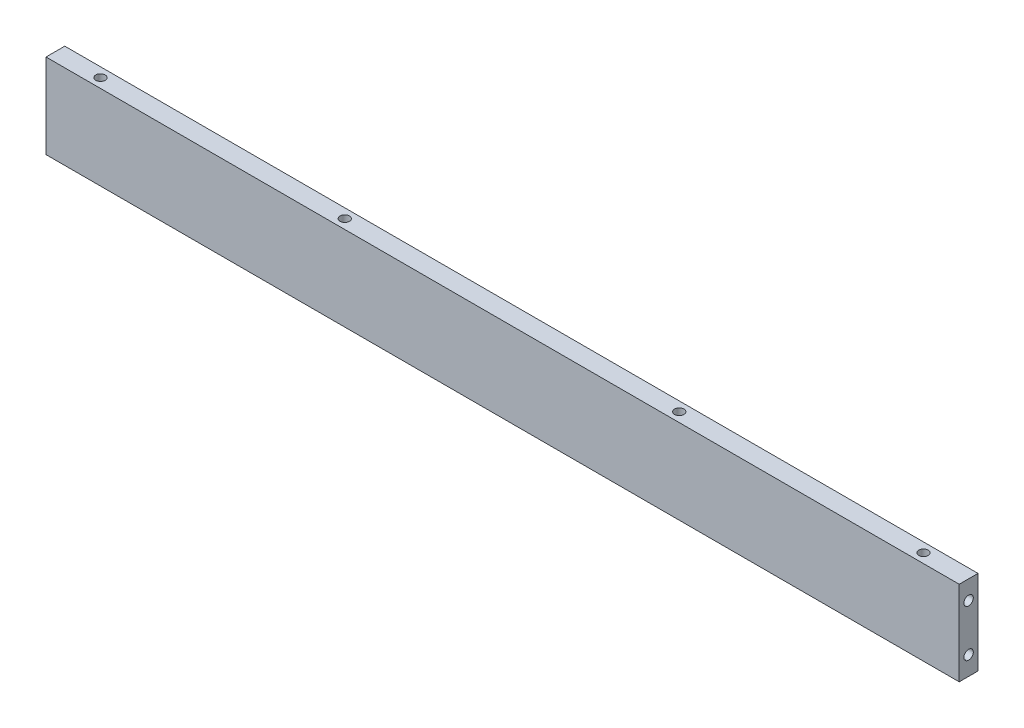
ISO-10303-21;
HEADER;
FILE_DESCRIPTION(('STEP AP214'),'2;1');
FILE_NAME('part.step','',(''),(''),'','','');
FILE_SCHEMA(('AUTOMOTIVE_DESIGN { 1 0 10303 214 1 1 1 1 }'));
ENDSEC;
DATA;
#1=APPLICATION_CONTEXT('core data for automotive mechanical design processes');
#2=APPLICATION_PROTOCOL_DEFINITION('international standard','automotive_design',2000,#1);
#3=PRODUCT_CONTEXT('',#1,'mechanical');
#4=PRODUCT('Part','Part','',(#3));
#5=PRODUCT_RELATED_PRODUCT_CATEGORY('part','',(#4));
#6=PRODUCT_DEFINITION_FORMATION('','',#4);
#7=PRODUCT_DEFINITION_CONTEXT('part definition',#1,'design');
#8=PRODUCT_DEFINITION('design','',#6,#7);
#9=PRODUCT_DEFINITION_SHAPE('','',#8);
#10=(LENGTH_UNIT() NAMED_UNIT(*) SI_UNIT(.MILLI.,.METRE.));
#11=(NAMED_UNIT(*) PLANE_ANGLE_UNIT() SI_UNIT($,.RADIAN.));
#12=(NAMED_UNIT(*) SI_UNIT($,.STERADIAN.) SOLID_ANGLE_UNIT());
#13=UNCERTAINTY_MEASURE_WITH_UNIT(LENGTH_MEASURE(1.E-05),#10,'distance_accuracy_value','');
#14=(GEOMETRIC_REPRESENTATION_CONTEXT(3) GLOBAL_UNCERTAINTY_ASSIGNED_CONTEXT((#13)) GLOBAL_UNIT_ASSIGNED_CONTEXT((#10,
#11,#12)) REPRESENTATION_CONTEXT('',''));
#15=CARTESIAN_POINT('',(0.,0.,0.));
#16=DIRECTION('',(0.,0.,1.));
#17=DIRECTION('',(1.,0.,0.));
#18=AXIS2_PLACEMENT_3D('',#15,#16,#17);
#19=CARTESIAN_POINT('',(308.61,28.575,6.35));
#20=DIRECTION('',(-1.,0.,0.));
#21=DIRECTION('',(0.,0.,1.));
#22=AXIS2_PLACEMENT_3D('',#19,#20,#21);
#23=PLANE('',#22);
#24=CARTESIAN_POINT('',(308.61,15.875,0.));
#25=DIRECTION('',(1.,0.,0.));
#26=DIRECTION('',(0.,0.,-1.));
#27=AXIS2_PLACEMENT_3D('',#24,#25,#26);
#28=CIRCLE('',#27,3.175);
#29=CARTESIAN_POINT('',(308.61,15.875,-3.175));
#30=VERTEX_POINT('',#29);
#31=EDGE_CURVE('E155',#30,#30,#28,.T.);
#32=ORIENTED_EDGE('',*,*,#31,.F.);
#33=EDGE_LOOP('',(#32));
#34=FACE_BOUND('',#33,.T.);
#35=CARTESIAN_POINT('',(308.61,-15.875,0.));
#36=DIRECTION('',(1.,0.,0.));
#37=DIRECTION('',(0.,0.,-1.));
#38=AXIS2_PLACEMENT_3D('',#35,#36,#37);
#39=CIRCLE('',#38,3.175);
#40=CARTESIAN_POINT('',(308.61,-15.875,-3.175));
#41=VERTEX_POINT('',#40);
#42=EDGE_CURVE('E149',#41,#41,#39,.T.);
#43=ORIENTED_EDGE('',*,*,#42,.F.);
#44=EDGE_LOOP('',(#43));
#45=FACE_BOUND('',#44,.T.);
#46=DIRECTION('',(0.,1.,0.));
#47=VECTOR('',#46,1.);
#48=CARTESIAN_POINT('',(308.61,28.575,-6.35));
#49=LINE('',#48,#47);
#50=CARTESIAN_POINT('',(308.61,-28.575,-6.35));
#51=VERTEX_POINT('',#50);
#52=CARTESIAN_POINT('',(308.61,28.575,-6.35));
#53=VERTEX_POINT('',#52);
#54=EDGE_CURVE('E111',#51,#53,#49,.T.);
#55=ORIENTED_EDGE('',*,*,#54,.T.);
#56=DIRECTION('',(0.,0.,-1.));
#57=VECTOR('',#56,1.);
#58=CARTESIAN_POINT('',(308.61,28.575,6.35));
#59=LINE('',#58,#57);
#60=CARTESIAN_POINT('',(308.61,28.575,6.35));
#61=VERTEX_POINT('',#60);
#62=EDGE_CURVE('E13',#61,#53,#59,.T.);
#63=ORIENTED_EDGE('',*,*,#62,.F.);
#64=DIRECTION('',(0.,1.,0.));
#65=VECTOR('',#64,1.);
#66=CARTESIAN_POINT('',(308.61,28.575,6.35));
#67=LINE('',#66,#65);
#68=CARTESIAN_POINT('',(308.61,-28.575,6.35));
#69=VERTEX_POINT('',#68);
#70=EDGE_CURVE('E99',#69,#61,#67,.T.);
#71=ORIENTED_EDGE('',*,*,#70,.F.);
#72=DIRECTION('',(0.,0.,-1.));
#73=VECTOR('',#72,1.);
#74=CARTESIAN_POINT('',(308.61,-28.575,6.35));
#75=LINE('',#74,#73);
#76=EDGE_CURVE('E107',#69,#51,#75,.T.);
#77=ORIENTED_EDGE('',*,*,#76,.T.);
#78=EDGE_LOOP('',(#55,#63,#71,#77));
#79=FACE_BOUND('',#78,.T.);
#80=ADVANCED_FACE('F48',(#34,#45,#79),#23,.F.);
#81=CARTESIAN_POINT('',(-308.61,28.575,6.35));
#82=DIRECTION('',(0.,-1.,0.));
#83=DIRECTION('',(0.,0.,-1.));
#84=AXIS2_PLACEMENT_3D('',#81,#82,#83);
#85=PLANE('',#84);
#86=CARTESIAN_POINT('',(-113.03,28.575,0.));
#87=DIRECTION('',(0.,-1.,0.));
#88=DIRECTION('',(0.,0.,1.));
#89=AXIS2_PLACEMENT_3D('',#86,#87,#88);
#90=CIRCLE('',#89,3.175);
#91=CARTESIAN_POINT('',(-113.03,28.575,3.175));
#92=VERTEX_POINT('',#91);
#93=EDGE_CURVE('E143',#92,#92,#90,.T.);
#94=ORIENTED_EDGE('',*,*,#93,.T.);
#95=EDGE_LOOP('',(#94));
#96=FACE_BOUND('',#95,.T.);
#97=CARTESIAN_POINT('',(-278.13,28.575,0.));
#98=DIRECTION('',(0.,-1.,0.));
#99=DIRECTION('',(0.,0.,1.));
#100=AXIS2_PLACEMENT_3D('',#97,#98,#99);
#101=CIRCLE('',#100,3.17499999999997);
#102=CARTESIAN_POINT('',(-278.13,28.575,3.17499999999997));
#103=VERTEX_POINT('',#102);
#104=EDGE_CURVE('E137',#103,#103,#101,.T.);
#105=ORIENTED_EDGE('',*,*,#104,.T.);
#106=EDGE_LOOP('',(#105));
#107=FACE_BOUND('',#106,.T.);
#108=CARTESIAN_POINT('',(113.03,28.575,0.));
#109=DIRECTION('',(0.,1.,0.));
#110=DIRECTION('',(0.,0.,1.));
#111=AXIS2_PLACEMENT_3D('',#108,#109,#110);
#112=CIRCLE('',#111,3.175);
#113=CARTESIAN_POINT('',(113.03,28.575,3.175));
#114=VERTEX_POINT('',#113);
#115=EDGE_CURVE('E131',#114,#114,#112,.T.);
#116=ORIENTED_EDGE('',*,*,#115,.F.);
#117=EDGE_LOOP('',(#116));
#118=FACE_BOUND('',#117,.T.);
#119=CARTESIAN_POINT('',(278.13,28.575,0.));
#120=DIRECTION('',(0.,1.,0.));
#121=DIRECTION('',(0.,0.,1.));
#122=AXIS2_PLACEMENT_3D('',#119,#120,#121);
#123=CIRCLE('',#122,3.17499999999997);
#124=CARTESIAN_POINT('',(278.13,28.575,3.17499999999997));
#125=VERTEX_POINT('',#124);
#126=EDGE_CURVE('E125',#125,#125,#123,.T.);
#127=ORIENTED_EDGE('',*,*,#126,.F.);
#128=EDGE_LOOP('',(#127));
#129=FACE_BOUND('',#128,.T.);
#130=DIRECTION('',(-1.,0.,0.));
#131=VECTOR('',#130,1.);
#132=CARTESIAN_POINT('',(-308.61,28.575,-6.35));
#133=LINE('',#132,#131);
#134=CARTESIAN_POINT('',(-308.61,28.575,-6.35));
#135=VERTEX_POINT('',#134);
#136=EDGE_CURVE('E103',#53,#135,#133,.T.);
#137=ORIENTED_EDGE('',*,*,#136,.T.);
#138=DIRECTION('',(0.,0.,-1.));
#139=VECTOR('',#138,1.);
#140=CARTESIAN_POINT('',(-308.61,28.575,6.35));
#141=LINE('',#140,#139);
#142=CARTESIAN_POINT('',(-308.61,28.575,6.35));
#143=VERTEX_POINT('',#142);
#144=EDGE_CURVE('E56',#143,#135,#141,.T.);
#145=ORIENTED_EDGE('',*,*,#144,.F.);
#146=DIRECTION('',(-1.,0.,0.));
#147=VECTOR('',#146,1.);
#148=CARTESIAN_POINT('',(-308.61,28.575,6.35));
#149=LINE('',#148,#147);
#150=EDGE_CURVE('E94',#61,#143,#149,.T.);
#151=ORIENTED_EDGE('',*,*,#150,.F.);
#152=ORIENTED_EDGE('',*,*,#62,.T.);
#153=EDGE_LOOP('',(#137,#145,#151,#152));
#154=FACE_BOUND('',#153,.T.);
#155=ADVANCED_FACE('F102',(#96,#107,#118,#129,#154),#85,.F.);
#156=CARTESIAN_POINT('',(-308.61,28.575,6.35));
#157=DIRECTION('',(1.,0.,0.));
#158=DIRECTION('',(0.,0.,-1.));
#159=AXIS2_PLACEMENT_3D('',#156,#157,#158);
#160=PLANE('',#159);
#161=CARTESIAN_POINT('',(-308.61,15.875,0.));
#162=DIRECTION('',(1.,0.,0.));
#163=DIRECTION('',(0.,0.,-1.));
#164=AXIS2_PLACEMENT_3D('',#161,#162,#163);
#165=CIRCLE('',#164,3.175);
#166=CARTESIAN_POINT('',(-308.61,15.875,3.175));
#167=VERTEX_POINT('',#166);
#168=EDGE_CURVE('E167',#167,#167,#165,.T.);
#169=ORIENTED_EDGE('',*,*,#168,.T.);
#170=EDGE_LOOP('',(#169));
#171=FACE_BOUND('',#170,.T.);
#172=CARTESIAN_POINT('',(-308.61,-15.875,0.));
#173=DIRECTION('',(1.,0.,0.));
#174=DIRECTION('',(0.,0.,-1.));
#175=AXIS2_PLACEMENT_3D('',#172,#173,#174);
#176=CIRCLE('',#175,3.175);
#177=CARTESIAN_POINT('',(-308.61,-15.875,3.175));
#178=VERTEX_POINT('',#177);
#179=EDGE_CURVE('E161',#178,#178,#176,.T.);
#180=ORIENTED_EDGE('',*,*,#179,.T.);
#181=EDGE_LOOP('',(#180));
#182=FACE_BOUND('',#181,.T.);
#183=DIRECTION('',(0.,-1.,0.));
#184=VECTOR('',#183,1.);
#185=CARTESIAN_POINT('',(-308.61,28.575,-6.35));
#186=LINE('',#185,#184);
#187=CARTESIAN_POINT('',(-308.61,-28.575,-6.35));
#188=VERTEX_POINT('',#187);
#189=EDGE_CURVE('E81',#135,#188,#186,.T.);
#190=ORIENTED_EDGE('',*,*,#189,.T.);
#191=DIRECTION('',(0.,0.,-1.));
#192=VECTOR('',#191,1.);
#193=CARTESIAN_POINT('',(-308.61,-28.575,6.35));
#194=LINE('',#193,#192);
#195=CARTESIAN_POINT('',(-308.61,-28.575,6.35));
#196=VERTEX_POINT('',#195);
#197=EDGE_CURVE('E104',#196,#188,#194,.T.);
#198=ORIENTED_EDGE('',*,*,#197,.F.);
#199=DIRECTION('',(0.,-1.,0.));
#200=VECTOR('',#199,1.);
#201=CARTESIAN_POINT('',(-308.61,28.575,6.35));
#202=LINE('',#201,#200);
#203=EDGE_CURVE('E97',#143,#196,#202,.T.);
#204=ORIENTED_EDGE('',*,*,#203,.F.);
#205=ORIENTED_EDGE('',*,*,#144,.T.);
#206=EDGE_LOOP('',(#190,#198,#204,#205));
#207=FACE_BOUND('',#206,.T.);
#208=ADVANCED_FACE('F105',(#171,#182,#207),#160,.F.);
#209=CARTESIAN_POINT('',(-308.61,-28.575,6.35));
#210=DIRECTION('',(0.,1.,0.));
#211=DIRECTION('',(0.,0.,1.));
#212=AXIS2_PLACEMENT_3D('',#209,#210,#211);
#213=PLANE('',#212);
#214=DIRECTION('',(1.,0.,0.));
#215=VECTOR('',#214,1.);
#216=CARTESIAN_POINT('',(-308.61,-28.575,-6.35));
#217=LINE('',#216,#215);
#218=EDGE_CURVE('E87',#188,#51,#217,.T.);
#219=ORIENTED_EDGE('',*,*,#218,.T.);
#220=ORIENTED_EDGE('',*,*,#76,.F.);
#221=DIRECTION('',(1.,0.,0.));
#222=VECTOR('',#221,1.);
#223=CARTESIAN_POINT('',(-308.61,-28.575,6.35));
#224=LINE('',#223,#222);
#225=EDGE_CURVE('E64',#196,#69,#224,.T.);
#226=ORIENTED_EDGE('',*,*,#225,.F.);
#227=ORIENTED_EDGE('',*,*,#197,.T.);
#228=EDGE_LOOP('',(#219,#220,#226,#227));
#229=FACE_BOUND('',#228,.T.);
#230=ADVANCED_FACE('F119',(#229),#213,.F.);
#231=CARTESIAN_POINT('',(0.,0.,6.35));
#232=DIRECTION('',(0.,0.,1.));
#233=DIRECTION('',(1.,0.,0.));
#234=AXIS2_PLACEMENT_3D('',#231,#232,#233);
#235=PLANE('',#234);
#236=ORIENTED_EDGE('',*,*,#70,.T.);
#237=ORIENTED_EDGE('',*,*,#150,.T.);
#238=ORIENTED_EDGE('',*,*,#203,.T.);
#239=ORIENTED_EDGE('',*,*,#225,.T.);
#240=EDGE_LOOP('',(#236,#237,#238,#239));
#241=FACE_BOUND('',#240,.T.);
#242=ADVANCED_FACE('F95',(#241),#235,.T.);
#243=CARTESIAN_POINT('',(0.,0.,-6.35));
#244=DIRECTION('',(0.,0.,1.));
#245=DIRECTION('',(1.,0.,0.));
#246=AXIS2_PLACEMENT_3D('',#243,#244,#245);
#247=PLANE('',#246);
#248=ORIENTED_EDGE('',*,*,#54,.F.);
#249=ORIENTED_EDGE('',*,*,#218,.F.);
#250=ORIENTED_EDGE('',*,*,#189,.F.);
#251=ORIENTED_EDGE('',*,*,#136,.F.);
#252=EDGE_LOOP('',(#248,#249,#250,#251));
#253=FACE_BOUND('',#252,.T.);
#254=ADVANCED_FACE('F122',(#253),#247,.F.);
#255=CARTESIAN_POINT('',(278.13,9.525,0.));
#256=DIRECTION('',(0.,1.,0.));
#257=DIRECTION('',(0.,0.,1.));
#258=AXIS2_PLACEMENT_3D('',#255,#256,#257);
#259=CYLINDRICAL_SURFACE('',#258,3.17499999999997);
#260=CARTESIAN_POINT('',(278.13,9.525,0.));
#261=DIRECTION('',(0.,1.,0.));
#262=DIRECTION('',(0.,0.,1.));
#263=AXIS2_PLACEMENT_3D('',#260,#261,#262);
#264=CIRCLE('',#263,3.17499999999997);
#265=CARTESIAN_POINT('',(278.13,9.52499999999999,3.17499999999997));
#266=VERTEX_POINT('',#265);
#267=EDGE_CURVE('E114',#266,#266,#264,.T.);
#268=CARTESIAN_POINT('',(278.13,9.52499999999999,3.17499999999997));
#269=CARTESIAN_POINT('',(278.13,9.72343749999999,3.17499999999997));
#270=CARTESIAN_POINT('',(278.13,9.92187499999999,3.17499999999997));
#271=CARTESIAN_POINT('',(278.13,10.31875,3.17499999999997));
#272=CARTESIAN_POINT('',(278.13,10.5171875,3.17499999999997));
#273=CARTESIAN_POINT('',(278.13,10.9140625,3.17499999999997));
#274=CARTESIAN_POINT('',(278.13,11.1125,3.17499999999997));
#275=CARTESIAN_POINT('',(278.13,11.509375,3.17499999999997));
#276=CARTESIAN_POINT('',(278.13,11.7078125,3.17499999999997));
#277=CARTESIAN_POINT('',(278.13,12.1046875,3.17499999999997));
#278=CARTESIAN_POINT('',(278.13,12.303125,3.17499999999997));
#279=CARTESIAN_POINT('',(278.13,12.7,3.17499999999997));
#280=CARTESIAN_POINT('',(278.13,12.8984375,3.17499999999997));
#281=CARTESIAN_POINT('',(278.13,13.2953125,3.17499999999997));
#282=CARTESIAN_POINT('',(278.13,13.49375,3.17499999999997));
#283=CARTESIAN_POINT('',(278.13,13.890625,3.17499999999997));
#284=CARTESIAN_POINT('',(278.13,14.0890625,3.17499999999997));
#285=CARTESIAN_POINT('',(278.13,14.4859375,3.17499999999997));
#286=CARTESIAN_POINT('',(278.13,14.684375,3.17499999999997));
#287=CARTESIAN_POINT('',(278.13,15.08125,3.17499999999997));
#288=CARTESIAN_POINT('',(278.13,15.2796875,3.17499999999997));
#289=CARTESIAN_POINT('',(278.13,15.6765625,3.17499999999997));
#290=CARTESIAN_POINT('',(278.13,15.875,3.17499999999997));
#291=CARTESIAN_POINT('',(278.13,16.271875,3.17499999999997));
#292=CARTESIAN_POINT('',(278.13,16.4703125,3.17499999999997));
#293=CARTESIAN_POINT('',(278.13,16.8671875,3.17499999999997));
#294=CARTESIAN_POINT('',(278.13,17.065625,3.17499999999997));
#295=CARTESIAN_POINT('',(278.13,17.4625,3.17499999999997));
#296=CARTESIAN_POINT('',(278.13,17.6609375,3.17499999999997));
#297=CARTESIAN_POINT('',(278.13,18.0578125,3.17499999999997));
#298=CARTESIAN_POINT('',(278.13,18.25625,3.17499999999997));
#299=CARTESIAN_POINT('',(278.13,18.653125,3.17499999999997));
#300=CARTESIAN_POINT('',(278.13,18.8515625,3.17499999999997));
#301=CARTESIAN_POINT('',(278.13,19.2484375,3.17499999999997));
#302=CARTESIAN_POINT('',(278.13,19.446875,3.17499999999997));
#303=CARTESIAN_POINT('',(278.13,19.84375,3.17499999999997));
#304=CARTESIAN_POINT('',(278.13,20.0421875,3.17499999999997));
#305=CARTESIAN_POINT('',(278.13,20.4390625,3.17499999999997));
#306=CARTESIAN_POINT('',(278.13,20.6375,3.17499999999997));
#307=CARTESIAN_POINT('',(278.13,21.034375,3.17499999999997));
#308=CARTESIAN_POINT('',(278.13,21.2328125,3.17499999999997));
#309=CARTESIAN_POINT('',(278.13,21.6296875,3.17499999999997));
#310=CARTESIAN_POINT('',(278.13,21.828125,3.17499999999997));
#311=CARTESIAN_POINT('',(278.13,22.225,3.17499999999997));
#312=CARTESIAN_POINT('',(278.13,22.4234375,3.17499999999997));
#313=CARTESIAN_POINT('',(278.13,22.8203125,3.17499999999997));
#314=CARTESIAN_POINT('',(278.13,23.01875,3.17499999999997));
#315=CARTESIAN_POINT('',(278.13,23.415625,3.17499999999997));
#316=CARTESIAN_POINT('',(278.13,23.6140625,3.17499999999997));
#317=CARTESIAN_POINT('',(278.13,24.0109375,3.17499999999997));
#318=CARTESIAN_POINT('',(278.13,24.209375,3.17499999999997));
#319=CARTESIAN_POINT('',(278.13,24.60625,3.17499999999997));
#320=CARTESIAN_POINT('',(278.13,24.8046875,3.17499999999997));
#321=CARTESIAN_POINT('',(278.13,25.2015625,3.17499999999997));
#322=CARTESIAN_POINT('',(278.13,25.4,3.17499999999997));
#323=CARTESIAN_POINT('',(278.13,25.796875,3.17499999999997));
#324=CARTESIAN_POINT('',(278.13,25.9953125,3.17499999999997));
#325=CARTESIAN_POINT('',(278.13,26.3921875,3.17499999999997));
#326=CARTESIAN_POINT('',(278.13,26.590625,3.17499999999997));
#327=CARTESIAN_POINT('',(278.13,26.9875,3.17499999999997));
#328=CARTESIAN_POINT('',(278.13,27.1859375,3.17499999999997));
#329=CARTESIAN_POINT('',(278.13,27.5828125,3.17499999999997));
#330=CARTESIAN_POINT('',(278.13,27.78125,3.17499999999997));
#331=CARTESIAN_POINT('',(278.13,28.178125,3.17499999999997));
#332=CARTESIAN_POINT('',(278.13,28.3765625,3.17499999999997));
#333=CARTESIAN_POINT('',(278.13,28.575,3.17499999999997));
#334=B_SPLINE_CURVE_WITH_KNOTS('',3,(#268,#269,#270,#271,#272,#273,#274,#275,#276,#277,#278,
#279,#280,#281,#282,#283,#284,#285,#286,#287,#288,#289,#290,#291,#292,#293,#294,#295,#296,#297,
#298,#299,#300,#301,#302,#303,#304,#305,#306,#307,#308,#309,#310,#311,#312,#313,#314,#315,#316,
#317,#318,#319,#320,#321,#322,#323,#324,#325,#326,#327,#328,#329,#330,#331,#332,#333),
.UNSPECIFIED.,.F.,.F.,(4,2,2,2,2,2,2,2,2,2,2,2,2,2,2,2,2,2,2,2,2,2,2,2,2,2,2,2,2,2,2,2,4),(0.,
0.5953125,1.190625,1.7859375,2.38125,2.9765625,3.571875,4.1671875,4.7625,5.3578125,5.953125,
6.5484375,7.14375,7.7390625,8.334375,8.9296875,9.525,10.1203125,10.715625,11.3109375,11.90625,
12.5015625,13.096875,13.6921875,14.2875,14.8828125,15.478125,16.0734375,16.66875,17.2640625,
17.859375,18.4546875,19.05),.UNSPECIFIED.);
#335=EDGE_CURVE('BSEAM235',#266,#125,#334,.T.);
#336=ORIENTED_EDGE('',*,*,#267,.F.);
#337=ORIENTED_EDGE('',*,*,#126,.T.);
#338=ORIENTED_EDGE('',*,*,#335,.T.);
#339=ORIENTED_EDGE('',*,*,#335,.F.);
#340=EDGE_LOOP('',(#336,#338,#337,#339));
#341=FACE_BOUND('',#340,.T.);
#342=ADVANCED_FACE('F235',(#341),#259,.F.);
#343=CARTESIAN_POINT('',(278.13,9.525,0.));
#344=DIRECTION('',(0.,1.,0.));
#345=DIRECTION('',(0.,0.,1.));
#346=AXIS2_PLACEMENT_3D('',#343,#344,#345);
#347=PLANE('',#346);
#348=ORIENTED_EDGE('',*,*,#267,.T.);
#349=EDGE_LOOP('',(#348));
#350=FACE_BOUND('',#349,.T.);
#351=ADVANCED_FACE('F231',(#350),#347,.T.);
#352=CARTESIAN_POINT('',(113.03,9.525,0.));
#353=DIRECTION('',(0.,1.,0.));
#354=DIRECTION('',(0.,0.,1.));
#355=AXIS2_PLACEMENT_3D('',#352,#353,#354);
#356=CYLINDRICAL_SURFACE('',#355,3.175);
#357=CARTESIAN_POINT('',(113.03,9.525,0.));
#358=DIRECTION('',(0.,1.,0.));
#359=DIRECTION('',(0.,0.,1.));
#360=AXIS2_PLACEMENT_3D('',#357,#358,#359);
#361=CIRCLE('',#360,3.175);
#362=CARTESIAN_POINT('',(113.03,9.52499999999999,3.175));
#363=VERTEX_POINT('',#362);
#364=EDGE_CURVE('E128',#363,#363,#361,.T.);
#365=CARTESIAN_POINT('',(113.03,9.52499999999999,3.175));
#366=CARTESIAN_POINT('',(113.03,9.72343749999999,3.175));
#367=CARTESIAN_POINT('',(113.03,9.92187499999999,3.175));
#368=CARTESIAN_POINT('',(113.03,10.31875,3.175));
#369=CARTESIAN_POINT('',(113.03,10.5171875,3.175));
#370=CARTESIAN_POINT('',(113.03,10.9140625,3.175));
#371=CARTESIAN_POINT('',(113.03,11.1125,3.175));
#372=CARTESIAN_POINT('',(113.03,11.509375,3.175));
#373=CARTESIAN_POINT('',(113.03,11.7078125,3.175));
#374=CARTESIAN_POINT('',(113.03,12.1046875,3.175));
#375=CARTESIAN_POINT('',(113.03,12.303125,3.175));
#376=CARTESIAN_POINT('',(113.03,12.7,3.175));
#377=CARTESIAN_POINT('',(113.03,12.8984375,3.175));
#378=CARTESIAN_POINT('',(113.03,13.2953125,3.175));
#379=CARTESIAN_POINT('',(113.03,13.49375,3.175));
#380=CARTESIAN_POINT('',(113.03,13.890625,3.175));
#381=CARTESIAN_POINT('',(113.03,14.0890625,3.175));
#382=CARTESIAN_POINT('',(113.03,14.4859375,3.175));
#383=CARTESIAN_POINT('',(113.03,14.684375,3.175));
#384=CARTESIAN_POINT('',(113.03,15.08125,3.175));
#385=CARTESIAN_POINT('',(113.03,15.2796875,3.175));
#386=CARTESIAN_POINT('',(113.03,15.6765625,3.175));
#387=CARTESIAN_POINT('',(113.03,15.875,3.175));
#388=CARTESIAN_POINT('',(113.03,16.271875,3.175));
#389=CARTESIAN_POINT('',(113.03,16.4703125,3.175));
#390=CARTESIAN_POINT('',(113.03,16.8671875,3.175));
#391=CARTESIAN_POINT('',(113.03,17.065625,3.175));
#392=CARTESIAN_POINT('',(113.03,17.4625,3.175));
#393=CARTESIAN_POINT('',(113.03,17.6609375,3.175));
#394=CARTESIAN_POINT('',(113.03,18.0578125,3.175));
#395=CARTESIAN_POINT('',(113.03,18.25625,3.175));
#396=CARTESIAN_POINT('',(113.03,18.653125,3.175));
#397=CARTESIAN_POINT('',(113.03,18.8515625,3.175));
#398=CARTESIAN_POINT('',(113.03,19.2484375,3.175));
#399=CARTESIAN_POINT('',(113.03,19.446875,3.175));
#400=CARTESIAN_POINT('',(113.03,19.84375,3.175));
#401=CARTESIAN_POINT('',(113.03,20.0421875,3.175));
#402=CARTESIAN_POINT('',(113.03,20.4390625,3.175));
#403=CARTESIAN_POINT('',(113.03,20.6375,3.175));
#404=CARTESIAN_POINT('',(113.03,21.034375,3.175));
#405=CARTESIAN_POINT('',(113.03,21.2328125,3.175));
#406=CARTESIAN_POINT('',(113.03,21.6296875,3.175));
#407=CARTESIAN_POINT('',(113.03,21.828125,3.175));
#408=CARTESIAN_POINT('',(113.03,22.225,3.175));
#409=CARTESIAN_POINT('',(113.03,22.4234375,3.175));
#410=CARTESIAN_POINT('',(113.03,22.8203125,3.175));
#411=CARTESIAN_POINT('',(113.03,23.01875,3.175));
#412=CARTESIAN_POINT('',(113.03,23.415625,3.175));
#413=CARTESIAN_POINT('',(113.03,23.6140625,3.175));
#414=CARTESIAN_POINT('',(113.03,24.0109375,3.175));
#415=CARTESIAN_POINT('',(113.03,24.209375,3.175));
#416=CARTESIAN_POINT('',(113.03,24.60625,3.175));
#417=CARTESIAN_POINT('',(113.03,24.8046875,3.175));
#418=CARTESIAN_POINT('',(113.03,25.2015625,3.175));
#419=CARTESIAN_POINT('',(113.03,25.4,3.175));
#420=CARTESIAN_POINT('',(113.03,25.796875,3.175));
#421=CARTESIAN_POINT('',(113.03,25.9953125,3.175));
#422=CARTESIAN_POINT('',(113.03,26.3921875,3.175));
#423=CARTESIAN_POINT('',(113.03,26.590625,3.175));
#424=CARTESIAN_POINT('',(113.03,26.9875,3.175));
#425=CARTESIAN_POINT('',(113.03,27.1859375,3.175));
#426=CARTESIAN_POINT('',(113.03,27.5828125,3.175));
#427=CARTESIAN_POINT('',(113.03,27.78125,3.175));
#428=CARTESIAN_POINT('',(113.03,28.178125,3.175));
#429=CARTESIAN_POINT('',(113.03,28.3765625,3.175));
#430=CARTESIAN_POINT('',(113.03,28.575,3.175));
#431=B_SPLINE_CURVE_WITH_KNOTS('',3,(#365,#366,#367,#368,#369,#370,#371,#372,#373,#374,#375,
#376,#377,#378,#379,#380,#381,#382,#383,#384,#385,#386,#387,#388,#389,#390,#391,#392,#393,#394,
#395,#396,#397,#398,#399,#400,#401,#402,#403,#404,#405,#406,#407,#408,#409,#410,#411,#412,#413,
#414,#415,#416,#417,#418,#419,#420,#421,#422,#423,#424,#425,#426,#427,#428,#429,#430),
.UNSPECIFIED.,.F.,.F.,(4,2,2,2,2,2,2,2,2,2,2,2,2,2,2,2,2,2,2,2,2,2,2,2,2,2,2,2,2,2,2,2,4),(0.,
0.5953125,1.190625,1.7859375,2.38125,2.9765625,3.571875,4.1671875,4.7625,5.3578125,5.953125,
6.5484375,7.14375,7.7390625,8.334375,8.9296875,9.525,10.1203125,10.715625,11.3109375,11.90625,
12.5015625,13.096875,13.6921875,14.2875,14.8828125,15.478125,16.0734375,16.66875,17.2640625,
17.859375,18.4546875,19.05),.UNSPECIFIED.);
#432=EDGE_CURVE('BSEAM227',#363,#114,#431,.T.);
#433=ORIENTED_EDGE('',*,*,#364,.F.);
#434=ORIENTED_EDGE('',*,*,#115,.T.);
#435=ORIENTED_EDGE('',*,*,#432,.T.);
#436=ORIENTED_EDGE('',*,*,#432,.F.);
#437=EDGE_LOOP('',(#433,#435,#434,#436));
#438=FACE_BOUND('',#437,.T.);
#439=ADVANCED_FACE('F227',(#438),#356,.F.);
#440=CARTESIAN_POINT('',(113.03,9.525,0.));
#441=DIRECTION('',(0.,1.,0.));
#442=DIRECTION('',(0.,0.,1.));
#443=AXIS2_PLACEMENT_3D('',#440,#441,#442);
#444=PLANE('',#443);
#445=ORIENTED_EDGE('',*,*,#364,.T.);
#446=EDGE_LOOP('',(#445));
#447=FACE_BOUND('',#446,.T.);
#448=ADVANCED_FACE('F223',(#447),#444,.T.);
#449=CARTESIAN_POINT('',(-278.13,9.525,0.));
#450=DIRECTION('',(0.,1.,0.));
#451=DIRECTION('',(0.,0.,1.));
#452=AXIS2_PLACEMENT_3D('',#449,#450,#451);
#453=CYLINDRICAL_SURFACE('',#452,3.17499999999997);
#454=CARTESIAN_POINT('',(-278.13,9.525,0.));
#455=DIRECTION('',(0.,-1.,0.));
#456=DIRECTION('',(0.,0.,1.));
#457=AXIS2_PLACEMENT_3D('',#454,#455,#456);
#458=CIRCLE('',#457,3.17499999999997);
#459=CARTESIAN_POINT('',(-278.13,9.525,3.17499999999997));
#460=VERTEX_POINT('',#459);
#461=EDGE_CURVE('E134',#460,#460,#458,.T.);
#462=CARTESIAN_POINT('',(-278.13,9.525,3.17499999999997));
#463=CARTESIAN_POINT('',(-278.13,9.7234375,3.17499999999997));
#464=CARTESIAN_POINT('',(-278.13,9.921875,3.17499999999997));
#465=CARTESIAN_POINT('',(-278.13,10.31875,3.17499999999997));
#466=CARTESIAN_POINT('',(-278.13,10.5171875,3.17499999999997));
#467=CARTESIAN_POINT('',(-278.13,10.9140625,3.17499999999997));
#468=CARTESIAN_POINT('',(-278.13,11.1125,3.17499999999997));
#469=CARTESIAN_POINT('',(-278.13,11.509375,3.17499999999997));
#470=CARTESIAN_POINT('',(-278.13,11.7078125,3.17499999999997));
#471=CARTESIAN_POINT('',(-278.13,12.1046875,3.17499999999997));
#472=CARTESIAN_POINT('',(-278.13,12.303125,3.17499999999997));
#473=CARTESIAN_POINT('',(-278.13,12.7,3.17499999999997));
#474=CARTESIAN_POINT('',(-278.13,12.8984375,3.17499999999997));
#475=CARTESIAN_POINT('',(-278.13,13.2953125,3.17499999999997));
#476=CARTESIAN_POINT('',(-278.13,13.49375,3.17499999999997));
#477=CARTESIAN_POINT('',(-278.13,13.890625,3.17499999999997));
#478=CARTESIAN_POINT('',(-278.13,14.0890625,3.17499999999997));
#479=CARTESIAN_POINT('',(-278.13,14.4859375,3.17499999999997));
#480=CARTESIAN_POINT('',(-278.13,14.684375,3.17499999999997));
#481=CARTESIAN_POINT('',(-278.13,15.08125,3.17499999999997));
#482=CARTESIAN_POINT('',(-278.13,15.2796875,3.17499999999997));
#483=CARTESIAN_POINT('',(-278.13,15.6765625,3.17499999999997));
#484=CARTESIAN_POINT('',(-278.13,15.875,3.17499999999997));
#485=CARTESIAN_POINT('',(-278.13,16.271875,3.17499999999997));
#486=CARTESIAN_POINT('',(-278.13,16.4703125,3.17499999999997));
#487=CARTESIAN_POINT('',(-278.13,16.8671875,3.17499999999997));
#488=CARTESIAN_POINT('',(-278.13,17.065625,3.17499999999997));
#489=CARTESIAN_POINT('',(-278.13,17.4625,3.17499999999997));
#490=CARTESIAN_POINT('',(-278.13,17.6609375,3.17499999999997));
#491=CARTESIAN_POINT('',(-278.13,18.0578125,3.17499999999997));
#492=CARTESIAN_POINT('',(-278.13,18.25625,3.17499999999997));
#493=CARTESIAN_POINT('',(-278.13,18.653125,3.17499999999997));
#494=CARTESIAN_POINT('',(-278.13,18.8515625,3.17499999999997));
#495=CARTESIAN_POINT('',(-278.13,19.2484375,3.17499999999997));
#496=CARTESIAN_POINT('',(-278.13,19.446875,3.17499999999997));
#497=CARTESIAN_POINT('',(-278.13,19.84375,3.17499999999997));
#498=CARTESIAN_POINT('',(-278.13,20.0421875,3.17499999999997));
#499=CARTESIAN_POINT('',(-278.13,20.4390625,3.17499999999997));
#500=CARTESIAN_POINT('',(-278.13,20.6375,3.17499999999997));
#501=CARTESIAN_POINT('',(-278.13,21.034375,3.17499999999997));
#502=CARTESIAN_POINT('',(-278.13,21.2328125,3.17499999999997));
#503=CARTESIAN_POINT('',(-278.13,21.6296875,3.17499999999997));
#504=CARTESIAN_POINT('',(-278.13,21.828125,3.17499999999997));
#505=CARTESIAN_POINT('',(-278.13,22.225,3.17499999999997));
#506=CARTESIAN_POINT('',(-278.13,22.4234375,3.17499999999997));
#507=CARTESIAN_POINT('',(-278.13,22.8203125,3.17499999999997));
#508=CARTESIAN_POINT('',(-278.13,23.01875,3.17499999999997));
#509=CARTESIAN_POINT('',(-278.13,23.415625,3.17499999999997));
#510=CARTESIAN_POINT('',(-278.13,23.6140625,3.17499999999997));
#511=CARTESIAN_POINT('',(-278.13,24.0109375,3.17499999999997));
#512=CARTESIAN_POINT('',(-278.13,24.209375,3.17499999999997));
#513=CARTESIAN_POINT('',(-278.13,24.60625,3.17499999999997));
#514=CARTESIAN_POINT('',(-278.13,24.8046875,3.17499999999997));
#515=CARTESIAN_POINT('',(-278.13,25.2015625,3.17499999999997));
#516=CARTESIAN_POINT('',(-278.13,25.4,3.17499999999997));
#517=CARTESIAN_POINT('',(-278.13,25.796875,3.17499999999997));
#518=CARTESIAN_POINT('',(-278.13,25.9953125,3.17499999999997));
#519=CARTESIAN_POINT('',(-278.13,26.3921875,3.17499999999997));
#520=CARTESIAN_POINT('',(-278.13,26.590625,3.17499999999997));
#521=CARTESIAN_POINT('',(-278.13,26.9875,3.17499999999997));
#522=CARTESIAN_POINT('',(-278.13,27.1859375,3.17499999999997));
#523=CARTESIAN_POINT('',(-278.13,27.5828125,3.17499999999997));
#524=CARTESIAN_POINT('',(-278.13,27.78125,3.17499999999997));
#525=CARTESIAN_POINT('',(-278.13,28.178125,3.17499999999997));
#526=CARTESIAN_POINT('',(-278.13,28.3765625,3.17499999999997));
#527=CARTESIAN_POINT('',(-278.13,28.575,3.17499999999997));
#528=B_SPLINE_CURVE_WITH_KNOTS('',3,(#462,#463,#464,#465,#466,#467,#468,#469,#470,#471,#472,
#473,#474,#475,#476,#477,#478,#479,#480,#481,#482,#483,#484,#485,#486,#487,#488,#489,#490,#491,
#492,#493,#494,#495,#496,#497,#498,#499,#500,#501,#502,#503,#504,#505,#506,#507,#508,#509,#510,
#511,#512,#513,#514,#515,#516,#517,#518,#519,#520,#521,#522,#523,#524,#525,#526,#527),
.UNSPECIFIED.,.F.,.F.,(4,2,2,2,2,2,2,2,2,2,2,2,2,2,2,2,2,2,2,2,2,2,2,2,2,2,2,2,2,2,2,2,4),(0.,
0.595312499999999,1.190625,1.7859375,2.38125,2.9765625,3.571875,4.1671875,4.7625,5.3578125,
5.953125,6.5484375,7.14375,7.7390625,8.334375,8.9296875,9.525,10.1203125,10.715625,11.3109375,
11.90625,12.5015625,13.096875,13.6921875,14.2875,14.8828125,15.478125,16.0734375,16.66875,
17.2640625,17.859375,18.4546875,19.05),.UNSPECIFIED.);
#529=EDGE_CURVE('BSEAM219',#460,#103,#528,.T.);
#530=ORIENTED_EDGE('',*,*,#461,.T.);
#531=ORIENTED_EDGE('',*,*,#104,.F.);
#532=ORIENTED_EDGE('',*,*,#529,.T.);
#533=ORIENTED_EDGE('',*,*,#529,.F.);
#534=EDGE_LOOP('',(#530,#532,#531,#533));
#535=FACE_BOUND('',#534,.T.);
#536=ADVANCED_FACE('F219',(#535),#453,.F.);
#537=CARTESIAN_POINT('',(-278.13,9.525,0.));
#538=DIRECTION('',(0.,1.,0.));
#539=DIRECTION('',(0.,0.,1.));
#540=AXIS2_PLACEMENT_3D('',#537,#538,#539);
#541=PLANE('',#540);
#542=ORIENTED_EDGE('',*,*,#461,.F.);
#543=EDGE_LOOP('',(#542));
#544=FACE_BOUND('',#543,.T.);
#545=ADVANCED_FACE('F215',(#544),#541,.T.);
#546=CARTESIAN_POINT('',(-113.03,9.525,0.));
#547=DIRECTION('',(0.,1.,0.));
#548=DIRECTION('',(0.,0.,1.));
#549=AXIS2_PLACEMENT_3D('',#546,#547,#548);
#550=CYLINDRICAL_SURFACE('',#549,3.175);
#551=CARTESIAN_POINT('',(-113.03,9.525,0.));
#552=DIRECTION('',(0.,-1.,0.));
#553=DIRECTION('',(0.,0.,1.));
#554=AXIS2_PLACEMENT_3D('',#551,#552,#553);
#555=CIRCLE('',#554,3.175);
#556=CARTESIAN_POINT('',(-113.03,9.525,3.175));
#557=VERTEX_POINT('',#556);
#558=EDGE_CURVE('E140',#557,#557,#555,.T.);
#559=CARTESIAN_POINT('',(-113.03,9.525,3.175));
#560=CARTESIAN_POINT('',(-113.03,9.7234375,3.175));
#561=CARTESIAN_POINT('',(-113.03,9.921875,3.175));
#562=CARTESIAN_POINT('',(-113.03,10.31875,3.175));
#563=CARTESIAN_POINT('',(-113.03,10.5171875,3.175));
#564=CARTESIAN_POINT('',(-113.03,10.9140625,3.175));
#565=CARTESIAN_POINT('',(-113.03,11.1125,3.175));
#566=CARTESIAN_POINT('',(-113.03,11.509375,3.175));
#567=CARTESIAN_POINT('',(-113.03,11.7078125,3.175));
#568=CARTESIAN_POINT('',(-113.03,12.1046875,3.175));
#569=CARTESIAN_POINT('',(-113.03,12.303125,3.175));
#570=CARTESIAN_POINT('',(-113.03,12.7,3.175));
#571=CARTESIAN_POINT('',(-113.03,12.8984375,3.175));
#572=CARTESIAN_POINT('',(-113.03,13.2953125,3.175));
#573=CARTESIAN_POINT('',(-113.03,13.49375,3.175));
#574=CARTESIAN_POINT('',(-113.03,13.890625,3.175));
#575=CARTESIAN_POINT('',(-113.03,14.0890625,3.175));
#576=CARTESIAN_POINT('',(-113.03,14.4859375,3.175));
#577=CARTESIAN_POINT('',(-113.03,14.684375,3.175));
#578=CARTESIAN_POINT('',(-113.03,15.08125,3.175));
#579=CARTESIAN_POINT('',(-113.03,15.2796875,3.175));
#580=CARTESIAN_POINT('',(-113.03,15.6765625,3.175));
#581=CARTESIAN_POINT('',(-113.03,15.875,3.175));
#582=CARTESIAN_POINT('',(-113.03,16.271875,3.175));
#583=CARTESIAN_POINT('',(-113.03,16.4703125,3.175));
#584=CARTESIAN_POINT('',(-113.03,16.8671875,3.175));
#585=CARTESIAN_POINT('',(-113.03,17.065625,3.175));
#586=CARTESIAN_POINT('',(-113.03,17.4625,3.175));
#587=CARTESIAN_POINT('',(-113.03,17.6609375,3.175));
#588=CARTESIAN_POINT('',(-113.03,18.0578125,3.175));
#589=CARTESIAN_POINT('',(-113.03,18.25625,3.175));
#590=CARTESIAN_POINT('',(-113.03,18.653125,3.175));
#591=CARTESIAN_POINT('',(-113.03,18.8515625,3.175));
#592=CARTESIAN_POINT('',(-113.03,19.2484375,3.175));
#593=CARTESIAN_POINT('',(-113.03,19.446875,3.175));
#594=CARTESIAN_POINT('',(-113.03,19.84375,3.175));
#595=CARTESIAN_POINT('',(-113.03,20.0421875,3.175));
#596=CARTESIAN_POINT('',(-113.03,20.4390625,3.175));
#597=CARTESIAN_POINT('',(-113.03,20.6375,3.175));
#598=CARTESIAN_POINT('',(-113.03,21.034375,3.175));
#599=CARTESIAN_POINT('',(-113.03,21.2328125,3.175));
#600=CARTESIAN_POINT('',(-113.03,21.6296875,3.175));
#601=CARTESIAN_POINT('',(-113.03,21.828125,3.175));
#602=CARTESIAN_POINT('',(-113.03,22.225,3.175));
#603=CARTESIAN_POINT('',(-113.03,22.4234375,3.175));
#604=CARTESIAN_POINT('',(-113.03,22.8203125,3.175));
#605=CARTESIAN_POINT('',(-113.03,23.01875,3.175));
#606=CARTESIAN_POINT('',(-113.03,23.415625,3.175));
#607=CARTESIAN_POINT('',(-113.03,23.6140625,3.175));
#608=CARTESIAN_POINT('',(-113.03,24.0109375,3.175));
#609=CARTESIAN_POINT('',(-113.03,24.209375,3.175));
#610=CARTESIAN_POINT('',(-113.03,24.60625,3.175));
#611=CARTESIAN_POINT('',(-113.03,24.8046875,3.175));
#612=CARTESIAN_POINT('',(-113.03,25.2015625,3.175));
#613=CARTESIAN_POINT('',(-113.03,25.4,3.175));
#614=CARTESIAN_POINT('',(-113.03,25.796875,3.175));
#615=CARTESIAN_POINT('',(-113.03,25.9953125,3.175));
#616=CARTESIAN_POINT('',(-113.03,26.3921875,3.175));
#617=CARTESIAN_POINT('',(-113.03,26.590625,3.175));
#618=CARTESIAN_POINT('',(-113.03,26.9875,3.175));
#619=CARTESIAN_POINT('',(-113.03,27.1859375,3.175));
#620=CARTESIAN_POINT('',(-113.03,27.5828125,3.175));
#621=CARTESIAN_POINT('',(-113.03,27.78125,3.175));
#622=CARTESIAN_POINT('',(-113.03,28.178125,3.175));
#623=CARTESIAN_POINT('',(-113.03,28.3765625,3.175));
#624=CARTESIAN_POINT('',(-113.03,28.575,3.175));
#625=B_SPLINE_CURVE_WITH_KNOTS('',3,(#559,#560,#561,#562,#563,#564,#565,#566,#567,#568,#569,
#570,#571,#572,#573,#574,#575,#576,#577,#578,#579,#580,#581,#582,#583,#584,#585,#586,#587,#588,
#589,#590,#591,#592,#593,#594,#595,#596,#597,#598,#599,#600,#601,#602,#603,#604,#605,#606,#607,
#608,#609,#610,#611,#612,#613,#614,#615,#616,#617,#618,#619,#620,#621,#622,#623,#624),
.UNSPECIFIED.,.F.,.F.,(4,2,2,2,2,2,2,2,2,2,2,2,2,2,2,2,2,2,2,2,2,2,2,2,2,2,2,2,2,2,2,2,4),(0.,
0.595312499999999,1.190625,1.7859375,2.38125,2.9765625,3.571875,4.1671875,4.7625,5.3578125,
5.953125,6.5484375,7.14375,7.7390625,8.334375,8.9296875,9.525,10.1203125,10.715625,11.3109375,
11.90625,12.5015625,13.096875,13.6921875,14.2875,14.8828125,15.478125,16.0734375,16.66875,
17.2640625,17.859375,18.4546875,19.05),.UNSPECIFIED.);
#626=EDGE_CURVE('BSEAM207',#557,#92,#625,.T.);
#627=ORIENTED_EDGE('',*,*,#558,.T.);
#628=ORIENTED_EDGE('',*,*,#93,.F.);
#629=ORIENTED_EDGE('',*,*,#626,.T.);
#630=ORIENTED_EDGE('',*,*,#626,.F.);
#631=EDGE_LOOP('',(#627,#629,#628,#630));
#632=FACE_BOUND('',#631,.T.);
#633=ADVANCED_FACE('F207',(#632),#550,.F.);
#634=CARTESIAN_POINT('',(-113.03,9.525,0.));
#635=DIRECTION('',(0.,1.,0.));
#636=DIRECTION('',(0.,0.,1.));
#637=AXIS2_PLACEMENT_3D('',#634,#635,#636);
#638=PLANE('',#637);
#639=ORIENTED_EDGE('',*,*,#558,.F.);
#640=EDGE_LOOP('',(#639));
#641=FACE_BOUND('',#640,.T.);
#642=ADVANCED_FACE('F197',(#641),#638,.T.);
#643=CARTESIAN_POINT('',(289.56,-15.875,0.));
#644=DIRECTION('',(1.,0.,0.));
#645=DIRECTION('',(0.,0.,-1.));
#646=AXIS2_PLACEMENT_3D('',#643,#644,#645);
#647=CYLINDRICAL_SURFACE('',#646,3.175);
#648=CARTESIAN_POINT('',(289.56,-15.875,0.));
#649=DIRECTION('',(1.,0.,0.));
#650=DIRECTION('',(0.,0.,-1.));
#651=AXIS2_PLACEMENT_3D('',#648,#649,#650);
#652=CIRCLE('',#651,3.175);
#653=CARTESIAN_POINT('',(289.56,-15.875,-3.175));
#654=VERTEX_POINT('',#653);
#655=EDGE_CURVE('E146',#654,#654,#652,.T.);
#656=CARTESIAN_POINT('',(289.56,-15.875,-3.175));
#657=CARTESIAN_POINT('',(289.7584375,-15.875,-3.175));
#658=CARTESIAN_POINT('',(289.956875,-15.875,-3.175));
#659=CARTESIAN_POINT('',(290.35375,-15.875,-3.175));
#660=CARTESIAN_POINT('',(290.5521875,-15.875,-3.175));
#661=CARTESIAN_POINT('',(290.9490625,-15.875,-3.175));
#662=CARTESIAN_POINT('',(291.1475,-15.875,-3.175));
#663=CARTESIAN_POINT('',(291.544375,-15.875,-3.175));
#664=CARTESIAN_POINT('',(291.7428125,-15.875,-3.175));
#665=CARTESIAN_POINT('',(292.1396875,-15.875,-3.175));
#666=CARTESIAN_POINT('',(292.338125,-15.875,-3.175));
#667=CARTESIAN_POINT('',(292.735,-15.875,-3.175));
#668=CARTESIAN_POINT('',(292.9334375,-15.875,-3.175));
#669=CARTESIAN_POINT('',(293.3303125,-15.875,-3.175));
#670=CARTESIAN_POINT('',(293.52875,-15.875,-3.175));
#671=CARTESIAN_POINT('',(293.925625,-15.875,-3.175));
#672=CARTESIAN_POINT('',(294.1240625,-15.875,-3.175));
#673=CARTESIAN_POINT('',(294.5209375,-15.875,-3.175));
#674=CARTESIAN_POINT('',(294.719375,-15.875,-3.175));
#675=CARTESIAN_POINT('',(295.11625,-15.875,-3.175));
#676=CARTESIAN_POINT('',(295.3146875,-15.875,-3.175));
#677=CARTESIAN_POINT('',(295.7115625,-15.875,-3.175));
#678=CARTESIAN_POINT('',(295.91,-15.875,-3.175));
#679=CARTESIAN_POINT('',(296.306875,-15.875,-3.175));
#680=CARTESIAN_POINT('',(296.5053125,-15.875,-3.175));
#681=CARTESIAN_POINT('',(296.9021875,-15.875,-3.175));
#682=CARTESIAN_POINT('',(297.100625,-15.875,-3.175));
#683=CARTESIAN_POINT('',(297.4975,-15.875,-3.175));
#684=CARTESIAN_POINT('',(297.6959375,-15.875,-3.175));
#685=CARTESIAN_POINT('',(298.0928125,-15.875,-3.175));
#686=CARTESIAN_POINT('',(298.29125,-15.875,-3.175));
#687=CARTESIAN_POINT('',(298.688125,-15.875,-3.175));
#688=CARTESIAN_POINT('',(298.8865625,-15.875,-3.175));
#689=CARTESIAN_POINT('',(299.2834375,-15.875,-3.175));
#690=CARTESIAN_POINT('',(299.481875,-15.875,-3.175));
#691=CARTESIAN_POINT('',(299.87875,-15.875,-3.175));
#692=CARTESIAN_POINT('',(300.0771875,-15.875,-3.175));
#693=CARTESIAN_POINT('',(300.4740625,-15.875,-3.175));
#694=CARTESIAN_POINT('',(300.6725,-15.875,-3.175));
#695=CARTESIAN_POINT('',(301.069375,-15.875,-3.175));
#696=CARTESIAN_POINT('',(301.2678125,-15.875,-3.175));
#697=CARTESIAN_POINT('',(301.6646875,-15.875,-3.175));
#698=CARTESIAN_POINT('',(301.863125,-15.875,-3.175));
#699=CARTESIAN_POINT('',(302.26,-15.875,-3.175));
#700=CARTESIAN_POINT('',(302.4584375,-15.875,-3.175));
#701=CARTESIAN_POINT('',(302.8553125,-15.875,-3.175));
#702=CARTESIAN_POINT('',(303.05375,-15.875,-3.175));
#703=CARTESIAN_POINT('',(303.450625,-15.875,-3.175));
#704=CARTESIAN_POINT('',(303.6490625,-15.875,-3.175));
#705=CARTESIAN_POINT('',(304.0459375,-15.875,-3.175));
#706=CARTESIAN_POINT('',(304.244375,-15.875,-3.175));
#707=CARTESIAN_POINT('',(304.64125,-15.875,-3.175));
#708=CARTESIAN_POINT('',(304.8396875,-15.875,-3.175));
#709=CARTESIAN_POINT('',(305.2365625,-15.875,-3.175));
#710=CARTESIAN_POINT('',(305.435,-15.875,-3.175));
#711=CARTESIAN_POINT('',(305.831875,-15.875,-3.175));
#712=CARTESIAN_POINT('',(306.0303125,-15.875,-3.175));
#713=CARTESIAN_POINT('',(306.4271875,-15.875,-3.175));
#714=CARTESIAN_POINT('',(306.625625,-15.875,-3.175));
#715=CARTESIAN_POINT('',(307.0225,-15.875,-3.175));
#716=CARTESIAN_POINT('',(307.2209375,-15.875,-3.175));
#717=CARTESIAN_POINT('',(307.6178125,-15.875,-3.175));
#718=CARTESIAN_POINT('',(307.81625,-15.875,-3.175));
#719=CARTESIAN_POINT('',(308.213125,-15.875,-3.175));
#720=CARTESIAN_POINT('',(308.4115625,-15.875,-3.175));
#721=CARTESIAN_POINT('',(308.61,-15.875,-3.175));
#722=B_SPLINE_CURVE_WITH_KNOTS('',3,(#656,#657,#658,#659,#660,#661,#662,#663,#664,#665,#666,
#667,#668,#669,#670,#671,#672,#673,#674,#675,#676,#677,#678,#679,#680,#681,#682,#683,#684,#685,
#686,#687,#688,#689,#690,#691,#692,#693,#694,#695,#696,#697,#698,#699,#700,#701,#702,#703,#704,
#705,#706,#707,#708,#709,#710,#711,#712,#713,#714,#715,#716,#717,#718,#719,#720,#721),
.UNSPECIFIED.,.F.,.F.,(4,2,2,2,2,2,2,2,2,2,2,2,2,2,2,2,2,2,2,2,2,2,2,2,2,2,2,2,2,2,2,2,4),(0.,
0.5953125,1.190625,1.7859375,2.38125,2.9765625,3.571875,4.1671875,4.7625,5.3578125,5.953125,
6.5484375,7.14375,7.7390625,8.334375,8.92968750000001,9.52500000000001,10.1203125,10.715625,
11.3109375,11.90625,12.5015625,13.096875,13.6921875,14.2875,14.8828125,15.478125,16.0734375,
16.66875,17.2640625,17.859375,18.4546875,19.05),.UNSPECIFIED.);
#723=EDGE_CURVE('BSEAM194',#654,#41,#722,.T.);
#724=ORIENTED_EDGE('',*,*,#655,.F.);
#725=ORIENTED_EDGE('',*,*,#42,.T.);
#726=ORIENTED_EDGE('',*,*,#723,.T.);
#727=ORIENTED_EDGE('',*,*,#723,.F.);
#728=EDGE_LOOP('',(#724,#726,#725,#727));
#729=FACE_BOUND('',#728,.T.);
#730=ADVANCED_FACE('F194',(#729),#647,.F.);
#731=CARTESIAN_POINT('',(289.56,-15.875,0.));
#732=DIRECTION('',(1.,0.,0.));
#733=DIRECTION('',(0.,0.,-1.));
#734=AXIS2_PLACEMENT_3D('',#731,#732,#733);
#735=PLANE('',#734);
#736=ORIENTED_EDGE('',*,*,#655,.T.);
#737=EDGE_LOOP('',(#736));
#738=FACE_BOUND('',#737,.T.);
#739=ADVANCED_FACE('F196',(#738),#735,.T.);
#740=CARTESIAN_POINT('',(289.56,15.875,0.));
#741=DIRECTION('',(1.,0.,0.));
#742=DIRECTION('',(0.,0.,-1.));
#743=AXIS2_PLACEMENT_3D('',#740,#741,#742);
#744=CYLINDRICAL_SURFACE('',#743,3.175);
#745=CARTESIAN_POINT('',(289.56,15.875,0.));
#746=DIRECTION('',(1.,0.,0.));
#747=DIRECTION('',(0.,0.,-1.));
#748=AXIS2_PLACEMENT_3D('',#745,#746,#747);
#749=CIRCLE('',#748,3.175);
#750=CARTESIAN_POINT('',(289.56,15.875,-3.175));
#751=VERTEX_POINT('',#750);
#752=EDGE_CURVE('E152',#751,#751,#749,.T.);
#753=CARTESIAN_POINT('',(289.56,15.875,-3.175));
#754=CARTESIAN_POINT('',(289.7584375,15.875,-3.175));
#755=CARTESIAN_POINT('',(289.956875,15.875,-3.175));
#756=CARTESIAN_POINT('',(290.35375,15.875,-3.175));
#757=CARTESIAN_POINT('',(290.5521875,15.875,-3.175));
#758=CARTESIAN_POINT('',(290.9490625,15.875,-3.175));
#759=CARTESIAN_POINT('',(291.1475,15.875,-3.175));
#760=CARTESIAN_POINT('',(291.544375,15.875,-3.175));
#761=CARTESIAN_POINT('',(291.7428125,15.875,-3.175));
#762=CARTESIAN_POINT('',(292.1396875,15.875,-3.175));
#763=CARTESIAN_POINT('',(292.338125,15.875,-3.175));
#764=CARTESIAN_POINT('',(292.735,15.875,-3.175));
#765=CARTESIAN_POINT('',(292.9334375,15.875,-3.175));
#766=CARTESIAN_POINT('',(293.3303125,15.875,-3.175));
#767=CARTESIAN_POINT('',(293.52875,15.875,-3.175));
#768=CARTESIAN_POINT('',(293.925625,15.875,-3.175));
#769=CARTESIAN_POINT('',(294.1240625,15.875,-3.175));
#770=CARTESIAN_POINT('',(294.5209375,15.875,-3.175));
#771=CARTESIAN_POINT('',(294.719375,15.875,-3.175));
#772=CARTESIAN_POINT('',(295.11625,15.875,-3.175));
#773=CARTESIAN_POINT('',(295.3146875,15.875,-3.175));
#774=CARTESIAN_POINT('',(295.7115625,15.875,-3.175));
#775=CARTESIAN_POINT('',(295.91,15.875,-3.175));
#776=CARTESIAN_POINT('',(296.306875,15.875,-3.175));
#777=CARTESIAN_POINT('',(296.5053125,15.875,-3.175));
#778=CARTESIAN_POINT('',(296.9021875,15.875,-3.175));
#779=CARTESIAN_POINT('',(297.100625,15.875,-3.175));
#780=CARTESIAN_POINT('',(297.4975,15.875,-3.175));
#781=CARTESIAN_POINT('',(297.6959375,15.875,-3.175));
#782=CARTESIAN_POINT('',(298.0928125,15.875,-3.175));
#783=CARTESIAN_POINT('',(298.29125,15.875,-3.175));
#784=CARTESIAN_POINT('',(298.688125,15.875,-3.175));
#785=CARTESIAN_POINT('',(298.8865625,15.875,-3.175));
#786=CARTESIAN_POINT('',(299.2834375,15.875,-3.175));
#787=CARTESIAN_POINT('',(299.481875,15.875,-3.175));
#788=CARTESIAN_POINT('',(299.87875,15.875,-3.175));
#789=CARTESIAN_POINT('',(300.0771875,15.875,-3.175));
#790=CARTESIAN_POINT('',(300.4740625,15.875,-3.175));
#791=CARTESIAN_POINT('',(300.6725,15.875,-3.175));
#792=CARTESIAN_POINT('',(301.069375,15.875,-3.175));
#793=CARTESIAN_POINT('',(301.2678125,15.875,-3.175));
#794=CARTESIAN_POINT('',(301.6646875,15.875,-3.175));
#795=CARTESIAN_POINT('',(301.863125,15.875,-3.175));
#796=CARTESIAN_POINT('',(302.26,15.875,-3.175));
#797=CARTESIAN_POINT('',(302.4584375,15.875,-3.175));
#798=CARTESIAN_POINT('',(302.8553125,15.875,-3.175));
#799=CARTESIAN_POINT('',(303.05375,15.875,-3.175));
#800=CARTESIAN_POINT('',(303.450625,15.875,-3.175));
#801=CARTESIAN_POINT('',(303.6490625,15.875,-3.175));
#802=CARTESIAN_POINT('',(304.0459375,15.875,-3.175));
#803=CARTESIAN_POINT('',(304.244375,15.875,-3.175));
#804=CARTESIAN_POINT('',(304.64125,15.875,-3.175));
#805=CARTESIAN_POINT('',(304.8396875,15.875,-3.175));
#806=CARTESIAN_POINT('',(305.2365625,15.875,-3.175));
#807=CARTESIAN_POINT('',(305.435,15.875,-3.175));
#808=CARTESIAN_POINT('',(305.831875,15.875,-3.175));
#809=CARTESIAN_POINT('',(306.0303125,15.875,-3.175));
#810=CARTESIAN_POINT('',(306.4271875,15.875,-3.175));
#811=CARTESIAN_POINT('',(306.625625,15.875,-3.175));
#812=CARTESIAN_POINT('',(307.0225,15.875,-3.175));
#813=CARTESIAN_POINT('',(307.2209375,15.875,-3.175));
#814=CARTESIAN_POINT('',(307.6178125,15.875,-3.175));
#815=CARTESIAN_POINT('',(307.81625,15.875,-3.175));
#816=CARTESIAN_POINT('',(308.213125,15.875,-3.175));
#817=CARTESIAN_POINT('',(308.4115625,15.875,-3.175));
#818=CARTESIAN_POINT('',(308.61,15.875,-3.175));
#819=B_SPLINE_CURVE_WITH_KNOTS('',3,(#753,#754,#755,#756,#757,#758,#759,#760,#761,#762,#763,
#764,#765,#766,#767,#768,#769,#770,#771,#772,#773,#774,#775,#776,#777,#778,#779,#780,#781,#782,
#783,#784,#785,#786,#787,#788,#789,#790,#791,#792,#793,#794,#795,#796,#797,#798,#799,#800,#801,
#802,#803,#804,#805,#806,#807,#808,#809,#810,#811,#812,#813,#814,#815,#816,#817,#818),
.UNSPECIFIED.,.F.,.F.,(4,2,2,2,2,2,2,2,2,2,2,2,2,2,2,2,2,2,2,2,2,2,2,2,2,2,2,2,2,2,2,2,4),(0.,
0.5953125,1.190625,1.7859375,2.38125,2.9765625,3.571875,4.1671875,4.7625,5.3578125,5.953125,
6.5484375,7.14375,7.7390625,8.334375,8.92968750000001,9.52500000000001,10.1203125,10.715625,
11.3109375,11.90625,12.5015625,13.096875,13.6921875,14.2875,14.8828125,15.478125,16.0734375,
16.66875,17.2640625,17.859375,18.4546875,19.05),.UNSPECIFIED.);
#820=EDGE_CURVE('BSEAM204',#751,#30,#819,.T.);
#821=ORIENTED_EDGE('',*,*,#752,.F.);
#822=ORIENTED_EDGE('',*,*,#31,.T.);
#823=ORIENTED_EDGE('',*,*,#820,.T.);
#824=ORIENTED_EDGE('',*,*,#820,.F.);
#825=EDGE_LOOP('',(#821,#823,#822,#824));
#826=FACE_BOUND('',#825,.T.);
#827=ADVANCED_FACE('F204',(#826),#744,.F.);
#828=CARTESIAN_POINT('',(289.56,15.875,0.));
#829=DIRECTION('',(1.,0.,0.));
#830=DIRECTION('',(0.,0.,-1.));
#831=AXIS2_PLACEMENT_3D('',#828,#829,#830);
#832=PLANE('',#831);
#833=ORIENTED_EDGE('',*,*,#752,.T.);
#834=EDGE_LOOP('',(#833));
#835=FACE_BOUND('',#834,.T.);
#836=ADVANCED_FACE('F256',(#835),#832,.T.);
#837=CARTESIAN_POINT('',(-289.56,-15.875,0.));
#838=DIRECTION('',(-1.,0.,0.));
#839=DIRECTION('',(0.,0.,1.));
#840=AXIS2_PLACEMENT_3D('',#837,#838,#839);
#841=CYLINDRICAL_SURFACE('',#840,3.175);
#842=CARTESIAN_POINT('',(-289.56,-15.875,0.));
#843=DIRECTION('',(1.,0.,0.));
#844=DIRECTION('',(0.,0.,-1.));
#845=AXIS2_PLACEMENT_3D('',#842,#843,#844);
#846=CIRCLE('',#845,3.175);
#847=CARTESIAN_POINT('',(-289.56,-15.875,3.175));
#848=VERTEX_POINT('',#847);
#849=EDGE_CURVE('E158',#848,#848,#846,.T.);
#850=CARTESIAN_POINT('',(-289.56,-15.875,3.175));
#851=CARTESIAN_POINT('',(-289.7584375,-15.875,3.175));
#852=CARTESIAN_POINT('',(-289.956875,-15.875,3.175));
#853=CARTESIAN_POINT('',(-290.35375,-15.875,3.175));
#854=CARTESIAN_POINT('',(-290.5521875,-15.875,3.175));
#855=CARTESIAN_POINT('',(-290.9490625,-15.875,3.175));
#856=CARTESIAN_POINT('',(-291.1475,-15.875,3.175));
#857=CARTESIAN_POINT('',(-291.544375,-15.875,3.175));
#858=CARTESIAN_POINT('',(-291.7428125,-15.875,3.175));
#859=CARTESIAN_POINT('',(-292.1396875,-15.875,3.175));
#860=CARTESIAN_POINT('',(-292.338125,-15.875,3.175));
#861=CARTESIAN_POINT('',(-292.735,-15.875,3.175));
#862=CARTESIAN_POINT('',(-292.9334375,-15.875,3.175));
#863=CARTESIAN_POINT('',(-293.3303125,-15.875,3.175));
#864=CARTESIAN_POINT('',(-293.52875,-15.875,3.175));
#865=CARTESIAN_POINT('',(-293.925625,-15.875,3.175));
#866=CARTESIAN_POINT('',(-294.1240625,-15.875,3.175));
#867=CARTESIAN_POINT('',(-294.5209375,-15.875,3.175));
#868=CARTESIAN_POINT('',(-294.719375,-15.875,3.175));
#869=CARTESIAN_POINT('',(-295.11625,-15.875,3.175));
#870=CARTESIAN_POINT('',(-295.3146875,-15.875,3.175));
#871=CARTESIAN_POINT('',(-295.7115625,-15.875,3.175));
#872=CARTESIAN_POINT('',(-295.91,-15.875,3.175));
#873=CARTESIAN_POINT('',(-296.306875,-15.875,3.175));
#874=CARTESIAN_POINT('',(-296.5053125,-15.875,3.175));
#875=CARTESIAN_POINT('',(-296.9021875,-15.875,3.175));
#876=CARTESIAN_POINT('',(-297.100625,-15.875,3.175));
#877=CARTESIAN_POINT('',(-297.4975,-15.875,3.175));
#878=CARTESIAN_POINT('',(-297.6959375,-15.875,3.175));
#879=CARTESIAN_POINT('',(-298.0928125,-15.875,3.175));
#880=CARTESIAN_POINT('',(-298.29125,-15.875,3.175));
#881=CARTESIAN_POINT('',(-298.688125,-15.875,3.175));
#882=CARTESIAN_POINT('',(-298.8865625,-15.875,3.175));
#883=CARTESIAN_POINT('',(-299.2834375,-15.875,3.175));
#884=CARTESIAN_POINT('',(-299.481875,-15.875,3.175));
#885=CARTESIAN_POINT('',(-299.87875,-15.875,3.175));
#886=CARTESIAN_POINT('',(-300.0771875,-15.875,3.175));
#887=CARTESIAN_POINT('',(-300.4740625,-15.875,3.175));
#888=CARTESIAN_POINT('',(-300.6725,-15.875,3.175));
#889=CARTESIAN_POINT('',(-301.069375,-15.875,3.175));
#890=CARTESIAN_POINT('',(-301.2678125,-15.875,3.175));
#891=CARTESIAN_POINT('',(-301.6646875,-15.875,3.175));
#892=CARTESIAN_POINT('',(-301.863125,-15.875,3.175));
#893=CARTESIAN_POINT('',(-302.26,-15.875,3.175));
#894=CARTESIAN_POINT('',(-302.4584375,-15.875,3.175));
#895=CARTESIAN_POINT('',(-302.8553125,-15.875,3.175));
#896=CARTESIAN_POINT('',(-303.05375,-15.875,3.175));
#897=CARTESIAN_POINT('',(-303.450625,-15.875,3.175));
#898=CARTESIAN_POINT('',(-303.6490625,-15.875,3.175));
#899=CARTESIAN_POINT('',(-304.0459375,-15.875,3.175));
#900=CARTESIAN_POINT('',(-304.244375,-15.875,3.175));
#901=CARTESIAN_POINT('',(-304.64125,-15.875,3.175));
#902=CARTESIAN_POINT('',(-304.8396875,-15.875,3.175));
#903=CARTESIAN_POINT('',(-305.2365625,-15.875,3.175));
#904=CARTESIAN_POINT('',(-305.435,-15.875,3.175));
#905=CARTESIAN_POINT('',(-305.831875,-15.875,3.175));
#906=CARTESIAN_POINT('',(-306.0303125,-15.875,3.175));
#907=CARTESIAN_POINT('',(-306.4271875,-15.875,3.175));
#908=CARTESIAN_POINT('',(-306.625625,-15.875,3.175));
#909=CARTESIAN_POINT('',(-307.0225,-15.875,3.175));
#910=CARTESIAN_POINT('',(-307.2209375,-15.875,3.175));
#911=CARTESIAN_POINT('',(-307.6178125,-15.875,3.175));
#912=CARTESIAN_POINT('',(-307.81625,-15.875,3.175));
#913=CARTESIAN_POINT('',(-308.213125,-15.875,3.175));
#914=CARTESIAN_POINT('',(-308.4115625,-15.875,3.175));
#915=CARTESIAN_POINT('',(-308.61,-15.875,3.175));
#916=B_SPLINE_CURVE_WITH_KNOTS('',3,(#850,#851,#852,#853,#854,#855,#856,#857,#858,#859,#860,
#861,#862,#863,#864,#865,#866,#867,#868,#869,#870,#871,#872,#873,#874,#875,#876,#877,#878,#879,
#880,#881,#882,#883,#884,#885,#886,#887,#888,#889,#890,#891,#892,#893,#894,#895,#896,#897,#898,
#899,#900,#901,#902,#903,#904,#905,#906,#907,#908,#909,#910,#911,#912,#913,#914,#915),
.UNSPECIFIED.,.F.,.F.,(4,2,2,2,2,2,2,2,2,2,2,2,2,2,2,2,2,2,2,2,2,2,2,2,2,2,2,2,2,2,2,2,4),(0.,
0.5953125,1.190625,1.7859375,2.38125,2.9765625,3.571875,4.1671875,4.7625,5.3578125,5.953125,
6.5484375,7.14375,7.7390625,8.334375,8.92968750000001,9.52500000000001,10.1203125,10.715625,
11.3109375,11.90625,12.5015625,13.096875,13.6921875,14.2875,14.8828125,15.478125,16.0734375,
16.66875,17.2640625,17.859375,18.4546875,19.05),.UNSPECIFIED.);
#917=EDGE_CURVE('BSEAM254',#848,#178,#916,.T.);
#918=ORIENTED_EDGE('',*,*,#849,.T.);
#919=ORIENTED_EDGE('',*,*,#179,.F.);
#920=ORIENTED_EDGE('',*,*,#917,.T.);
#921=ORIENTED_EDGE('',*,*,#917,.F.);
#922=EDGE_LOOP('',(#918,#920,#919,#921));
#923=FACE_BOUND('',#922,.T.);
#924=ADVANCED_FACE('F254',(#923),#841,.F.);
#925=CARTESIAN_POINT('',(-289.56,-15.875,0.));
#926=DIRECTION('',(-1.,0.,0.));
#927=DIRECTION('',(0.,0.,-1.));
#928=AXIS2_PLACEMENT_3D('',#925,#926,#927);
#929=PLANE('',#928);
#930=ORIENTED_EDGE('',*,*,#849,.F.);
#931=EDGE_LOOP('',(#930));
#932=FACE_BOUND('',#931,.T.);
#933=ADVANCED_FACE('F182',(#932),#929,.T.);
#934=CARTESIAN_POINT('',(-289.56,15.875,0.));
#935=DIRECTION('',(-1.,0.,0.));
#936=DIRECTION('',(0.,0.,1.));
#937=AXIS2_PLACEMENT_3D('',#934,#935,#936);
#938=CYLINDRICAL_SURFACE('',#937,3.175);
#939=CARTESIAN_POINT('',(-289.56,15.875,0.));
#940=DIRECTION('',(1.,0.,0.));
#941=DIRECTION('',(0.,0.,-1.));
#942=AXIS2_PLACEMENT_3D('',#939,#940,#941);
#943=CIRCLE('',#942,3.175);
#944=CARTESIAN_POINT('',(-289.56,15.875,3.175));
#945=VERTEX_POINT('',#944);
#946=EDGE_CURVE('E164',#945,#945,#943,.T.);
#947=CARTESIAN_POINT('',(-289.56,15.875,3.175));
#948=CARTESIAN_POINT('',(-289.7584375,15.875,3.175));
#949=CARTESIAN_POINT('',(-289.956875,15.875,3.175));
#950=CARTESIAN_POINT('',(-290.35375,15.875,3.175));
#951=CARTESIAN_POINT('',(-290.5521875,15.875,3.175));
#952=CARTESIAN_POINT('',(-290.9490625,15.875,3.175));
#953=CARTESIAN_POINT('',(-291.1475,15.875,3.175));
#954=CARTESIAN_POINT('',(-291.544375,15.875,3.175));
#955=CARTESIAN_POINT('',(-291.7428125,15.875,3.175));
#956=CARTESIAN_POINT('',(-292.1396875,15.875,3.175));
#957=CARTESIAN_POINT('',(-292.338125,15.875,3.175));
#958=CARTESIAN_POINT('',(-292.735,15.875,3.175));
#959=CARTESIAN_POINT('',(-292.9334375,15.875,3.175));
#960=CARTESIAN_POINT('',(-293.3303125,15.875,3.175));
#961=CARTESIAN_POINT('',(-293.52875,15.875,3.175));
#962=CARTESIAN_POINT('',(-293.925625,15.875,3.175));
#963=CARTESIAN_POINT('',(-294.1240625,15.875,3.175));
#964=CARTESIAN_POINT('',(-294.5209375,15.875,3.175));
#965=CARTESIAN_POINT('',(-294.719375,15.875,3.175));
#966=CARTESIAN_POINT('',(-295.11625,15.875,3.175));
#967=CARTESIAN_POINT('',(-295.3146875,15.875,3.175));
#968=CARTESIAN_POINT('',(-295.7115625,15.875,3.175));
#969=CARTESIAN_POINT('',(-295.91,15.875,3.175));
#970=CARTESIAN_POINT('',(-296.306875,15.875,3.175));
#971=CARTESIAN_POINT('',(-296.5053125,15.875,3.175));
#972=CARTESIAN_POINT('',(-296.9021875,15.875,3.175));
#973=CARTESIAN_POINT('',(-297.100625,15.875,3.175));
#974=CARTESIAN_POINT('',(-297.4975,15.875,3.175));
#975=CARTESIAN_POINT('',(-297.6959375,15.875,3.175));
#976=CARTESIAN_POINT('',(-298.0928125,15.875,3.175));
#977=CARTESIAN_POINT('',(-298.29125,15.875,3.175));
#978=CARTESIAN_POINT('',(-298.688125,15.875,3.175));
#979=CARTESIAN_POINT('',(-298.8865625,15.875,3.175));
#980=CARTESIAN_POINT('',(-299.2834375,15.875,3.175));
#981=CARTESIAN_POINT('',(-299.481875,15.875,3.175));
#982=CARTESIAN_POINT('',(-299.87875,15.875,3.175));
#983=CARTESIAN_POINT('',(-300.0771875,15.875,3.175));
#984=CARTESIAN_POINT('',(-300.4740625,15.875,3.175));
#985=CARTESIAN_POINT('',(-300.6725,15.875,3.175));
#986=CARTESIAN_POINT('',(-301.069375,15.875,3.175));
#987=CARTESIAN_POINT('',(-301.2678125,15.875,3.175));
#988=CARTESIAN_POINT('',(-301.6646875,15.875,3.175));
#989=CARTESIAN_POINT('',(-301.863125,15.875,3.175));
#990=CARTESIAN_POINT('',(-302.26,15.875,3.175));
#991=CARTESIAN_POINT('',(-302.4584375,15.875,3.175));
#992=CARTESIAN_POINT('',(-302.8553125,15.875,3.175));
#993=CARTESIAN_POINT('',(-303.05375,15.875,3.175));
#994=CARTESIAN_POINT('',(-303.450625,15.875,3.175));
#995=CARTESIAN_POINT('',(-303.6490625,15.875,3.175));
#996=CARTESIAN_POINT('',(-304.0459375,15.875,3.175));
#997=CARTESIAN_POINT('',(-304.244375,15.875,3.175));
#998=CARTESIAN_POINT('',(-304.64125,15.875,3.175));
#999=CARTESIAN_POINT('',(-304.8396875,15.875,3.175));
#1000=CARTESIAN_POINT('',(-305.2365625,15.875,3.175));
#1001=CARTESIAN_POINT('',(-305.435,15.875,3.175));
#1002=CARTESIAN_POINT('',(-305.831875,15.875,3.175));
#1003=CARTESIAN_POINT('',(-306.0303125,15.875,3.175));
#1004=CARTESIAN_POINT('',(-306.4271875,15.875,3.175));
#1005=CARTESIAN_POINT('',(-306.625625,15.875,3.175));
#1006=CARTESIAN_POINT('',(-307.0225,15.875,3.175));
#1007=CARTESIAN_POINT('',(-307.2209375,15.875,3.175));
#1008=CARTESIAN_POINT('',(-307.6178125,15.875,3.175));
#1009=CARTESIAN_POINT('',(-307.81625,15.875,3.175));
#1010=CARTESIAN_POINT('',(-308.213125,15.875,3.175));
#1011=CARTESIAN_POINT('',(-308.4115625,15.875,3.175));
#1012=CARTESIAN_POINT('',(-308.61,15.875,3.175));
#1013=B_SPLINE_CURVE_WITH_KNOTS('',3,(#947,#948,#949,#950,#951,#952,#953,#954,#955,#956,#957,
#958,#959,#960,#961,#962,#963,#964,#965,#966,#967,#968,#969,#970,#971,#972,#973,#974,#975,#976,
#977,#978,#979,#980,#981,#982,#983,#984,#985,#986,#987,#988,#989,#990,#991,#992,#993,#994,#995,
#996,#997,#998,#999,#1000,#1001,#1002,#1003,#1004,#1005,#1006,#1007,#1008,#1009,#1010,#1011,
#1012),.UNSPECIFIED.,.F.,.F.,(4,2,2,2,2,2,2,2,2,2,2,2,2,2,2,2,2,2,2,2,2,2,2,2,2,2,2,2,2,2,2,2,
4),(0.,0.5953125,1.190625,1.7859375,2.38125,2.9765625,3.571875,4.1671875,4.7625,5.3578125,
5.953125,6.5484375,7.14375,7.7390625,8.334375,8.92968750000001,9.52500000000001,10.1203125,
10.715625,11.3109375,11.90625,12.5015625,13.096875,13.6921875,14.2875,14.8828125,15.478125,
16.0734375,16.66875,17.2640625,17.859375,18.4546875,19.05),.UNSPECIFIED.);
#1014=EDGE_CURVE('BSEAM173',#945,#167,#1013,.T.);
#1015=ORIENTED_EDGE('',*,*,#946,.T.);
#1016=ORIENTED_EDGE('',*,*,#168,.F.);
#1017=ORIENTED_EDGE('',*,*,#1014,.T.);
#1018=ORIENTED_EDGE('',*,*,#1014,.F.);
#1019=EDGE_LOOP('',(#1015,#1017,#1016,#1018));
#1020=FACE_BOUND('',#1019,.T.);
#1021=ADVANCED_FACE('F173',(#1020),#938,.F.);
#1022=CARTESIAN_POINT('',(-289.56,15.875,0.));
#1023=DIRECTION('',(-1.,0.,0.));
#1024=DIRECTION('',(0.,0.,-1.));
#1025=AXIS2_PLACEMENT_3D('',#1022,#1023,#1024);
#1026=PLANE('',#1025);
#1027=ORIENTED_EDGE('',*,*,#946,.F.);
#1028=EDGE_LOOP('',(#1027));
#1029=FACE_BOUND('',#1028,.T.);
#1030=ADVANCED_FACE('F176',(#1029),#1026,.T.);
#1031=CLOSED_SHELL('',(#80,#155,#208,#230,#242,#254,#342,#351,#439,#448,#536,#545,#633,#642,
#730,#739,#827,#836,#924,#933,#1021,#1030));
#1032=MANIFOLD_SOLID_BREP('B2',#1031);
#1033=ADVANCED_BREP_SHAPE_REPRESENTATION('',(#18,#1032),#14);
#1034=SHAPE_DEFINITION_REPRESENTATION(#9,#1033);
ENDSEC;
END-ISO-10303-21;
